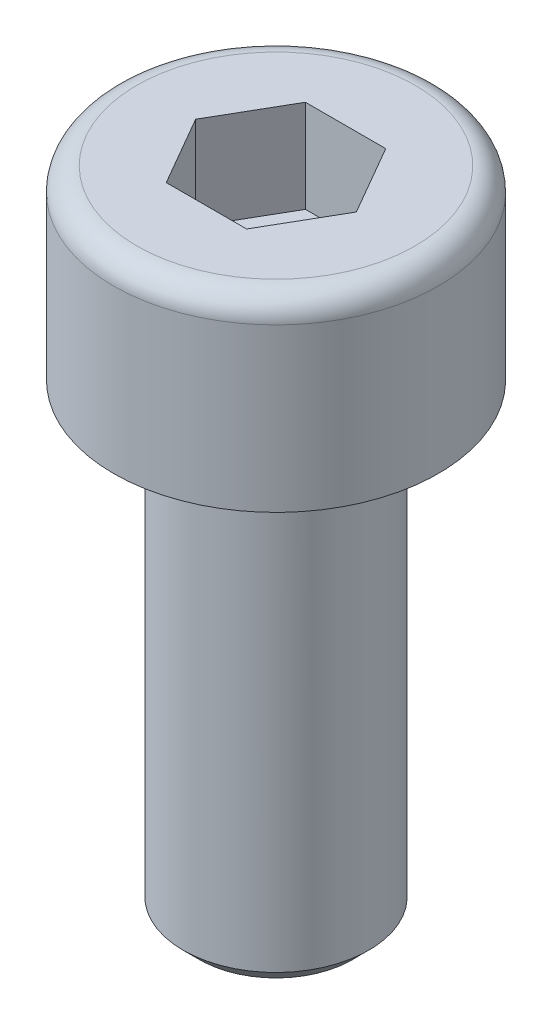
ISO-10303-21;
HEADER;
FILE_DESCRIPTION(('STEP AP214'),'2;1');
FILE_NAME('part.step','',(''),(''),'','','');
FILE_SCHEMA(('AUTOMOTIVE_DESIGN { 1 0 10303 214 1 1 1 1 }'));
ENDSEC;
DATA;
#1=APPLICATION_CONTEXT('core data for automotive mechanical design processes');
#2=APPLICATION_PROTOCOL_DEFINITION('international standard','automotive_design',2000,#1);
#3=PRODUCT_CONTEXT('',#1,'mechanical');
#4=PRODUCT('Part','Part','',(#3));
#5=PRODUCT_RELATED_PRODUCT_CATEGORY('part','',(#4));
#6=PRODUCT_DEFINITION_FORMATION('','',#4);
#7=PRODUCT_DEFINITION_CONTEXT('part definition',#1,'design');
#8=PRODUCT_DEFINITION('design','',#6,#7);
#9=PRODUCT_DEFINITION_SHAPE('','',#8);
#10=(LENGTH_UNIT() NAMED_UNIT(*) SI_UNIT(.MILLI.,.METRE.));
#11=(NAMED_UNIT(*) PLANE_ANGLE_UNIT() SI_UNIT($,.RADIAN.));
#12=(NAMED_UNIT(*) SI_UNIT($,.STERADIAN.) SOLID_ANGLE_UNIT());
#13=UNCERTAINTY_MEASURE_WITH_UNIT(LENGTH_MEASURE(1.E-05),#10,'distance_accuracy_value','');
#14=(GEOMETRIC_REPRESENTATION_CONTEXT(3) GLOBAL_UNCERTAINTY_ASSIGNED_CONTEXT((#13)) GLOBAL_UNIT_ASSIGNED_CONTEXT((#10,
#11,#12)) REPRESENTATION_CONTEXT('',''));
#15=CARTESIAN_POINT('',(0.,0.,0.));
#16=DIRECTION('',(0.,0.,1.));
#17=DIRECTION('',(1.,0.,0.));
#18=AXIS2_PLACEMENT_3D('',#15,#16,#17);
#19=CARTESIAN_POINT('',(0.,14.,0.));
#20=DIRECTION('',(0.,1.,0.));
#21=DIRECTION('',(0.,0.,1.));
#22=AXIS2_PLACEMENT_3D('',#19,#20,#21);
#23=PLANE('',#22);
#24=CARTESIAN_POINT('',(0.,14.,0.));
#25=DIRECTION('',(0.,1.,0.));
#26=DIRECTION('',(0.,0.,1.));
#27=AXIS2_PLACEMENT_3D('',#24,#25,#26);
#28=CIRCLE('',#27,3.);
#29=CARTESIAN_POINT('',(0.,14.,3.));
#30=VERTEX_POINT('',#29);
#31=EDGE_CURVE('E97',#30,#30,#28,.T.);
#32=ORIENTED_EDGE('',*,*,#31,.T.);
#33=EDGE_LOOP('',(#32));
#34=FACE_BOUND('',#33,.T.);
#35=DIRECTION('',(0.5,0.,-0.866025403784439));
#36=VECTOR('',#35,1.);
#37=CARTESIAN_POINT('',(-1.73205080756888,14.,0.));
#38=LINE('',#37,#36);
#39=CARTESIAN_POINT('',(-1.73205080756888,14.,0.));
#40=VERTEX_POINT('',#39);
#41=CARTESIAN_POINT('',(-0.866025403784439,14.,-1.5));
#42=VERTEX_POINT('',#41);
#43=EDGE_CURVE('E102',#40,#42,#38,.T.);
#44=ORIENTED_EDGE('',*,*,#43,.T.);
#45=DIRECTION('',(1.,0.,0.));
#46=VECTOR('',#45,1.);
#47=CARTESIAN_POINT('',(-0.866025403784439,14.,-1.5));
#48=LINE('',#47,#46);
#49=CARTESIAN_POINT('',(0.866025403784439,14.,-1.5));
#50=VERTEX_POINT('',#49);
#51=EDGE_CURVE('E43',#42,#50,#48,.T.);
#52=ORIENTED_EDGE('',*,*,#51,.T.);
#53=DIRECTION('',(0.5,0.,0.866025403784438));
#54=VECTOR('',#53,1.);
#55=CARTESIAN_POINT('',(0.866025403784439,14.,-1.5));
#56=LINE('',#55,#54);
#57=CARTESIAN_POINT('',(1.73205080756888,14.,0.));
#58=VERTEX_POINT('',#57);
#59=EDGE_CURVE('E83',#50,#58,#56,.T.);
#60=ORIENTED_EDGE('',*,*,#59,.T.);
#61=DIRECTION('',(-0.5,0.,0.866025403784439));
#62=VECTOR('',#61,1.);
#63=CARTESIAN_POINT('',(1.73205080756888,14.,0.));
#64=LINE('',#63,#62);
#65=CARTESIAN_POINT('',(0.866025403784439,14.,1.5));
#66=VERTEX_POINT('',#65);
#67=EDGE_CURVE('E91',#58,#66,#64,.T.);
#68=ORIENTED_EDGE('',*,*,#67,.T.);
#69=DIRECTION('',(-1.,0.,0.));
#70=VECTOR('',#69,1.);
#71=CARTESIAN_POINT('',(0.866025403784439,14.,1.5));
#72=LINE('',#71,#70);
#73=CARTESIAN_POINT('',(-0.866025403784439,14.,1.5));
#74=VERTEX_POINT('',#73);
#75=EDGE_CURVE('E106',#66,#74,#72,.T.);
#76=ORIENTED_EDGE('',*,*,#75,.T.);
#77=DIRECTION('',(-0.5,0.,-0.866025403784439));
#78=VECTOR('',#77,1.);
#79=CARTESIAN_POINT('',(-0.866025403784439,14.,1.5));
#80=LINE('',#79,#78);
#81=EDGE_CURVE('E109',#74,#40,#80,.T.);
#82=ORIENTED_EDGE('',*,*,#81,.T.);
#83=EDGE_LOOP('',(#44,#52,#60,#68,#76,#82));
#84=FACE_BOUND('',#83,.T.);
#85=ADVANCED_FACE('F28',(#34,#84),#23,.T.);
#86=CARTESIAN_POINT('',(-2.00000000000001,0.,0.));
#87=DIRECTION('',(0.,-1.,0.));
#88=DIRECTION('',(0.,0.,-1.));
#89=AXIS2_PLACEMENT_3D('',#86,#87,#88);
#90=PLANE('',#89);
#91=CARTESIAN_POINT('',(0.,0.,0.));
#92=DIRECTION('',(0.,-1.,0.));
#93=DIRECTION('',(0.,0.,-1.));
#94=AXIS2_PLACEMENT_3D('',#91,#92,#93);
#95=CIRCLE('',#94,1.65);
#96=CARTESIAN_POINT('',(0.,0.,-1.65));
#97=VERTEX_POINT('',#96);
#98=EDGE_CURVE('E11',#97,#97,#95,.T.);
#99=ORIENTED_EDGE('',*,*,#98,.T.);
#100=EDGE_LOOP('',(#99));
#101=FACE_BOUND('',#100,.T.);
#102=ADVANCED_FACE('F30',(#101),#90,.T.);
#103=CARTESIAN_POINT('',(0.,21.7617263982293,0.));
#104=DIRECTION('',(0.,1.,0.));
#105=DIRECTION('',(0.,0.,1.));
#106=AXIS2_PLACEMENT_3D('',#103,#104,#105);
#107=CYLINDRICAL_SURFACE('',#106,2.00000000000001);
#108=CARTESIAN_POINT('',(0.,0.350000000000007,0.));
#109=DIRECTION('',(0.,-1.,0.));
#110=DIRECTION('',(0.,0.,-1.));
#111=AXIS2_PLACEMENT_3D('',#108,#109,#110);
#112=CIRCLE('',#111,2.00000000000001);
#113=CARTESIAN_POINT('',(0.,0.350000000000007,-2.00000000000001));
#114=VERTEX_POINT('',#113);
#115=EDGE_CURVE('E36',#114,#114,#112,.F.);
#116=ORIENTED_EDGE('',*,*,#115,.T.);
#117=EDGE_LOOP('',(#116));
#118=FACE_BOUND('',#117,.T.);
#119=CARTESIAN_POINT('',(0.,10.,0.));
#120=DIRECTION('',(0.,1.,0.));
#121=DIRECTION('',(0.,0.,1.));
#122=AXIS2_PLACEMENT_3D('',#119,#120,#121);
#123=CIRCLE('',#122,2.);
#124=CARTESIAN_POINT('',(0.,10.,2.));
#125=VERTEX_POINT('',#124);
#126=EDGE_CURVE('E139',#125,#125,#123,.T.);
#127=ORIENTED_EDGE('',*,*,#126,.F.);
#128=EDGE_LOOP('',(#127));
#129=FACE_BOUND('',#128,.T.);
#130=ADVANCED_FACE('F144',(#118,#129),#107,.T.);
#131=CARTESIAN_POINT('',(-3.5,10.,0.));
#132=DIRECTION('',(0.,-1.,0.));
#133=DIRECTION('',(0.,0.,-1.));
#134=AXIS2_PLACEMENT_3D('',#131,#132,#133);
#135=PLANE('',#134);
#136=ORIENTED_EDGE('',*,*,#126,.T.);
#137=EDGE_LOOP('',(#136));
#138=FACE_BOUND('',#137,.T.);
#139=CARTESIAN_POINT('',(0.,10.,0.));
#140=DIRECTION('',(0.,1.,0.));
#141=DIRECTION('',(0.,0.,1.));
#142=AXIS2_PLACEMENT_3D('',#139,#140,#141);
#143=CIRCLE('',#142,3.5);
#144=CARTESIAN_POINT('',(0.,10.,3.5));
#145=VERTEX_POINT('',#144);
#146=EDGE_CURVE('E136',#145,#145,#143,.T.);
#147=ORIENTED_EDGE('',*,*,#146,.F.);
#148=EDGE_LOOP('',(#147));
#149=FACE_BOUND('',#148,.T.);
#150=ADVANCED_FACE('F176',(#138,#149),#135,.T.);
#151=CARTESIAN_POINT('',(0.,21.7617263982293,0.));
#152=DIRECTION('',(0.,1.,0.));
#153=DIRECTION('',(0.,0.,1.));
#154=AXIS2_PLACEMENT_3D('',#151,#152,#153);
#155=CYLINDRICAL_SURFACE('',#154,3.50000000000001);
#156=ORIENTED_EDGE('',*,*,#146,.T.);
#157=EDGE_LOOP('',(#156));
#158=FACE_BOUND('',#157,.T.);
#159=CARTESIAN_POINT('',(0.,13.5,0.));
#160=DIRECTION('',(0.,1.,0.));
#161=DIRECTION('',(0.,0.,1.));
#162=AXIS2_PLACEMENT_3D('',#159,#160,#161);
#163=CIRCLE('',#162,3.50000000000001);
#164=CARTESIAN_POINT('',(0.,13.5,3.50000000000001));
#165=VERTEX_POINT('',#164);
#166=EDGE_CURVE('E133',#165,#165,#163,.T.);
#167=ORIENTED_EDGE('',*,*,#166,.F.);
#168=EDGE_LOOP('',(#167));
#169=FACE_BOUND('',#168,.T.);
#170=ADVANCED_FACE('F172',(#158,#169),#155,.T.);
#171=CARTESIAN_POINT('',(0.,13.5,0.));
#172=DIRECTION('',(0.,1.,0.));
#173=DIRECTION('',(0.,0.,1.));
#174=AXIS2_PLACEMENT_3D('',#171,#172,#173);
#175=TOROIDAL_SURFACE('',#174,3.,0.500000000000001);
#176=ORIENTED_EDGE('',*,*,#31,.F.);
#177=EDGE_LOOP('',(#176));
#178=FACE_BOUND('',#177,.T.);
#179=ORIENTED_EDGE('',*,*,#166,.T.);
#180=EDGE_LOOP('',(#179));
#181=FACE_BOUND('',#180,.T.);
#182=ADVANCED_FACE('F169',(#178,#181),#175,.T.);
#183=CARTESIAN_POINT('',(-0.866025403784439,12.,-1.5));
#184=DIRECTION('',(0.,0.,1.));
#185=DIRECTION('',(1.,0.,0.));
#186=AXIS2_PLACEMENT_3D('',#183,#184,#185);
#187=PLANE('',#186);
#188=ORIENTED_EDGE('',*,*,#51,.F.);
#189=DIRECTION('',(0.,1.,0.));
#190=VECTOR('',#189,1.);
#191=CARTESIAN_POINT('',(-0.866025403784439,12.,-1.5));
#192=LINE('',#191,#190);
#193=CARTESIAN_POINT('',(-0.866025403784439,12.,-1.5));
#194=VERTEX_POINT('',#193);
#195=EDGE_CURVE('E122',#194,#42,#192,.T.);
#196=ORIENTED_EDGE('',*,*,#195,.F.);
#197=DIRECTION('',(1.,0.,0.));
#198=VECTOR('',#197,1.);
#199=CARTESIAN_POINT('',(-0.866025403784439,12.,-1.5));
#200=LINE('',#199,#198);
#201=CARTESIAN_POINT('',(0.866025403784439,12.,-1.5));
#202=VERTEX_POINT('',#201);
#203=EDGE_CURVE('E96',#194,#202,#200,.T.);
#204=ORIENTED_EDGE('',*,*,#203,.T.);
#205=DIRECTION('',(0.,1.,0.));
#206=VECTOR('',#205,1.);
#207=CARTESIAN_POINT('',(0.866025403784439,12.,-1.5));
#208=LINE('',#207,#206);
#209=EDGE_CURVE('E85',#202,#50,#208,.T.);
#210=ORIENTED_EDGE('',*,*,#209,.T.);
#211=EDGE_LOOP('',(#188,#196,#204,#210));
#212=FACE_BOUND('',#211,.T.);
#213=ADVANCED_FACE('F94',(#212),#187,.T.);
#214=CARTESIAN_POINT('',(0.866025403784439,12.,-1.5));
#215=DIRECTION('',(-0.866025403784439,0.,0.5));
#216=DIRECTION('',(0.5,0.,0.866025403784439));
#217=AXIS2_PLACEMENT_3D('',#214,#215,#216);
#218=PLANE('',#217);
#219=ORIENTED_EDGE('',*,*,#59,.F.);
#220=ORIENTED_EDGE('',*,*,#209,.F.);
#221=DIRECTION('',(0.5,0.,0.866025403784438));
#222=VECTOR('',#221,1.);
#223=CARTESIAN_POINT('',(0.866025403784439,12.,-1.5));
#224=LINE('',#223,#222);
#225=CARTESIAN_POINT('',(1.73205080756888,12.,0.));
#226=VERTEX_POINT('',#225);
#227=EDGE_CURVE('E113',#202,#226,#224,.T.);
#228=ORIENTED_EDGE('',*,*,#227,.T.);
#229=DIRECTION('',(0.,1.,0.));
#230=VECTOR('',#229,1.);
#231=CARTESIAN_POINT('',(1.73205080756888,12.,0.));
#232=LINE('',#231,#230);
#233=EDGE_CURVE('E87',#226,#58,#232,.T.);
#234=ORIENTED_EDGE('',*,*,#233,.T.);
#235=EDGE_LOOP('',(#219,#220,#228,#234));
#236=FACE_BOUND('',#235,.T.);
#237=ADVANCED_FACE('F84',(#236),#218,.T.);
#238=CARTESIAN_POINT('',(1.73205080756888,12.,0.));
#239=DIRECTION('',(-0.866025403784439,0.,-0.5));
#240=DIRECTION('',(-0.5,0.,0.866025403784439));
#241=AXIS2_PLACEMENT_3D('',#238,#239,#240);
#242=PLANE('',#241);
#243=ORIENTED_EDGE('',*,*,#67,.F.);
#244=ORIENTED_EDGE('',*,*,#233,.F.);
#245=DIRECTION('',(-0.5,0.,0.866025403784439));
#246=VECTOR('',#245,1.);
#247=CARTESIAN_POINT('',(1.73205080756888,12.,0.));
#248=LINE('',#247,#246);
#249=CARTESIAN_POINT('',(0.866025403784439,12.,1.5));
#250=VERTEX_POINT('',#249);
#251=EDGE_CURVE('E115',#226,#250,#248,.T.);
#252=ORIENTED_EDGE('',*,*,#251,.T.);
#253=DIRECTION('',(0.,1.,0.));
#254=VECTOR('',#253,1.);
#255=CARTESIAN_POINT('',(0.866025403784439,12.,1.5));
#256=LINE('',#255,#254);
#257=EDGE_CURVE('E128',#250,#66,#256,.T.);
#258=ORIENTED_EDGE('',*,*,#257,.T.);
#259=EDGE_LOOP('',(#243,#244,#252,#258));
#260=FACE_BOUND('',#259,.T.);
#261=ADVANCED_FACE('F208',(#260),#242,.T.);
#262=CARTESIAN_POINT('',(0.866025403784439,12.,1.5));
#263=DIRECTION('',(0.,0.,-1.));
#264=DIRECTION('',(-1.,0.,0.));
#265=AXIS2_PLACEMENT_3D('',#262,#263,#264);
#266=PLANE('',#265);
#267=ORIENTED_EDGE('',*,*,#75,.F.);
#268=ORIENTED_EDGE('',*,*,#257,.F.);
#269=DIRECTION('',(-1.,0.,0.));
#270=VECTOR('',#269,1.);
#271=CARTESIAN_POINT('',(0.866025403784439,12.,1.5));
#272=LINE('',#271,#270);
#273=CARTESIAN_POINT('',(-0.866025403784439,12.,1.5));
#274=VERTEX_POINT('',#273);
#275=EDGE_CURVE('E117',#250,#274,#272,.T.);
#276=ORIENTED_EDGE('',*,*,#275,.T.);
#277=DIRECTION('',(0.,1.,0.));
#278=VECTOR('',#277,1.);
#279=CARTESIAN_POINT('',(-0.866025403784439,12.,1.5));
#280=LINE('',#279,#278);
#281=EDGE_CURVE('E126',#274,#74,#280,.T.);
#282=ORIENTED_EDGE('',*,*,#281,.T.);
#283=EDGE_LOOP('',(#267,#268,#276,#282));
#284=FACE_BOUND('',#283,.T.);
#285=ADVANCED_FACE('F214',(#284),#266,.T.);
#286=CARTESIAN_POINT('',(-0.866025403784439,12.,1.5));
#287=DIRECTION('',(0.866025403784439,0.,-0.5));
#288=DIRECTION('',(-0.5,0.,-0.866025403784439));
#289=AXIS2_PLACEMENT_3D('',#286,#287,#288);
#290=PLANE('',#289);
#291=ORIENTED_EDGE('',*,*,#81,.F.);
#292=ORIENTED_EDGE('',*,*,#281,.F.);
#293=DIRECTION('',(-0.5,0.,-0.866025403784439));
#294=VECTOR('',#293,1.);
#295=CARTESIAN_POINT('',(-0.866025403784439,12.,1.5));
#296=LINE('',#295,#294);
#297=CARTESIAN_POINT('',(-1.73205080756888,12.,0.));
#298=VERTEX_POINT('',#297);
#299=EDGE_CURVE('E119',#274,#298,#296,.T.);
#300=ORIENTED_EDGE('',*,*,#299,.T.);
#301=DIRECTION('',(0.,1.,0.));
#302=VECTOR('',#301,1.);
#303=CARTESIAN_POINT('',(-1.73205080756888,12.,0.));
#304=LINE('',#303,#302);
#305=EDGE_CURVE('E124',#298,#40,#304,.T.);
#306=ORIENTED_EDGE('',*,*,#305,.T.);
#307=EDGE_LOOP('',(#291,#292,#300,#306));
#308=FACE_BOUND('',#307,.T.);
#309=ADVANCED_FACE('F222',(#308),#290,.T.);
#310=CARTESIAN_POINT('',(-1.73205080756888,12.,0.));
#311=DIRECTION('',(0.866025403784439,0.,0.5));
#312=DIRECTION('',(0.5,0.,-0.866025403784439));
#313=AXIS2_PLACEMENT_3D('',#310,#311,#312);
#314=PLANE('',#313);
#315=ORIENTED_EDGE('',*,*,#43,.F.);
#316=ORIENTED_EDGE('',*,*,#305,.F.);
#317=DIRECTION('',(0.5,0.,-0.866025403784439));
#318=VECTOR('',#317,1.);
#319=CARTESIAN_POINT('',(-1.73205080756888,12.,0.));
#320=LINE('',#319,#318);
#321=EDGE_CURVE('E50',#298,#194,#320,.T.);
#322=ORIENTED_EDGE('',*,*,#321,.T.);
#323=ORIENTED_EDGE('',*,*,#195,.T.);
#324=EDGE_LOOP('',(#315,#316,#322,#323));
#325=FACE_BOUND('',#324,.T.);
#326=ADVANCED_FACE('F155',(#325),#314,.T.);
#327=CARTESIAN_POINT('',(2.59807621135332,12.,-1.5));
#328=DIRECTION('',(0.,-1.,0.));
#329=DIRECTION('',(0.,0.,-1.));
#330=AXIS2_PLACEMENT_3D('',#327,#328,#329);
#331=PLANE('',#330);
#332=ORIENTED_EDGE('',*,*,#203,.F.);
#333=ORIENTED_EDGE('',*,*,#321,.F.);
#334=ORIENTED_EDGE('',*,*,#299,.F.);
#335=ORIENTED_EDGE('',*,*,#275,.F.);
#336=ORIENTED_EDGE('',*,*,#251,.F.);
#337=ORIENTED_EDGE('',*,*,#227,.F.);
#338=EDGE_LOOP('',(#332,#333,#334,#335,#336,#337));
#339=FACE_BOUND('',#338,.T.);
#340=ADVANCED_FACE('F149',(#339),#331,.F.);
#341=CARTESIAN_POINT('',(0.,0.350000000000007,0.));
#342=DIRECTION('',(0.,1.,0.));
#343=DIRECTION('',(0.,0.,1.));
#344=AXIS2_PLACEMENT_3D('',#341,#342,#343);
#345=CONICAL_SURFACE('',#344,2.00000000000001,0.785398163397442);
#346=ORIENTED_EDGE('',*,*,#98,.F.);
#347=EDGE_LOOP('',(#346));
#348=FACE_BOUND('',#347,.T.);
#349=ORIENTED_EDGE('',*,*,#115,.F.);
#350=EDGE_LOOP('',(#349));
#351=FACE_BOUND('',#350,.T.);
#352=ADVANCED_FACE('F147',(#348,#351),#345,.T.);
#353=CLOSED_SHELL('',(#85,#102,#130,#150,#170,#182,#213,#237,#261,#285,#309,#326,#340,#352));
#354=MANIFOLD_SOLID_BREP('B2',#353);
#355=ADVANCED_BREP_SHAPE_REPRESENTATION('',(#18,#354),#14);
#356=SHAPE_DEFINITION_REPRESENTATION(#9,#355);
ENDSEC;
END-ISO-10303-21;
